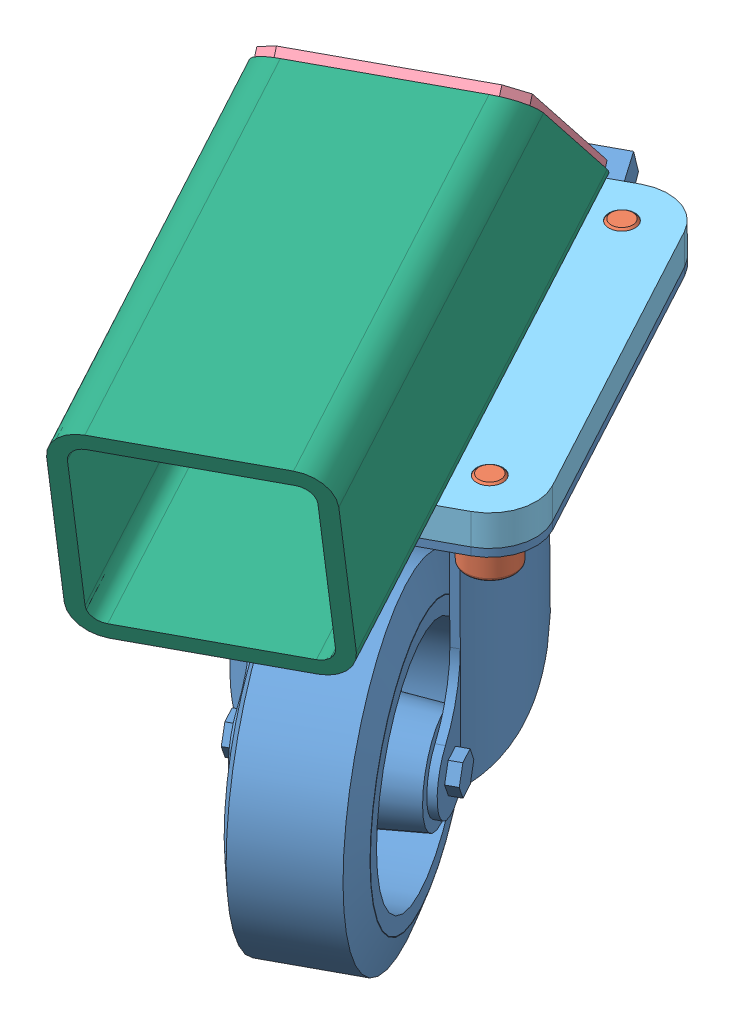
SolidWorks assembly Montage des roulettes.SLDASM, configuration Défaut (file format 5000). Lengths in mm.
Overall size (242.46 312.54 295.72).
13 component instances, 6 part files, 8 mates.
Components (placement in the parent):
- Roulette-1: Roulette.SLDPRT [Défaut] at (-390.9889 -260.5811 -478.0656) x (-0.472758 0.004166 -0.881182) z (0.881192 0.002235 -0.472753) size (199 139 110)
- Vis C HC, M 10x15-1: Vis C HC, M 10x15.sldprt [Défaut] at (-380.561 -264.7729 -543.259) x (-0.850954 -0.002483 0.525234) z (0.52524 -0.004023 0.850945) size (16 25 16)
- Rondelle M, 10-4: Rondelle M, 10.sldprt [Défaut] at (-380.561 -262.7729 -543.2496) x (0.142472 -0.004679 0.989788) z (0.989799 0.000674 -0.142471) size (22 2 22)
- Rondelle M, 10-5: Rondelle M, 10.sldprt [Défaut] at (-451.0564 -262.9517 -505.4293) x (0.142472 -0.004679 0.989788) z (0.989799 0.000674 -0.142471) size (22 2 22)
- Rondelle M, 10-6: Rondelle M, 10.sldprt [Défaut] at (-330.9214 -263.2103 -450.7254) x (0.142472 -0.004679 0.989788) z (0.989799 0.000674 -0.142471) size (22 2 22)
- Rondelle M, 10-7: Rondelle M, 10.sldprt [Défaut] at (-401.4168 -263.3891 -412.9052) x (0.142472 -0.004679 0.989788) z (0.989799 0.000674 -0.142471) size (22 2 22)
- Vis C HC, M 10x15-2: Vis C HC, M 10x15.sldprt [Défaut] at (-451.0564 -264.9517 -505.4388) x (-0.850954 -0.002483 0.525234) z (0.52524 -0.004023 0.850945) size (16 25 16)
- Vis C HC, M 10x15-3: Vis C HC, M 10x15.sldprt [Défaut] at (-330.9214 -265.2103 -450.7349) x (-0.850954 -0.002483 0.525234) z (0.52524 -0.004023 0.850945) size (16 25 16)
- Vis C HC, M 10x15-4: Vis C HC, M 10x15.sldprt [Défaut] at (-401.4168 -265.3891 -412.9147) x (-0.850954 -0.002483 0.525234) z (0.52524 -0.004023 0.850945) size (16 25 16)
- Extremité chariot-1: Extremité chariot.SLDASM [Défaut] at (-406.3544 -215.448 -506.4928) x (-0.881192 -0.002235 0.472753) z (-0.334291 0.710045 -0.619747) size (110 215.89 208.82)
  - Bouchon chariot 95 x 66 x 3-1: Bouchon chariot 95 x 66 x 3.SLDPRT [Défaut] at origin size (66 95 3)
  - Platine chariot 140 x 115 x 10-1: Platine chariot 140 x 115 x 10.SLDPRT [Défaut] at (0 -8.8363 -54.8008) x (0 0.707107 -0.707107) z (0 0.707107 0.707107) size (135 110 10)
  - Tube carré chariot 70 x 70 x 5 x 225.3-1: Tube carré chariot 70 x 70 x 5 x 225.3.SLDPRT [Défaut] at (0 134.5801 -134.5776) x (1 0 0) z (0 -0.707107 0.707107) size (70 70 225.32)
Mates (geometry in assembly coordinates):
- Coaxiale19: concentric anti-aligned: cylinder of Vis C HC, M 10x15-1 through (-380.561 -249.7731 -543.1881) axis (0 -0.999989 -0.004727) radius 5; cylinder of Rondelle M, 10-4 through (-380.561 -262.7729 -543.2496) axis (0 0.999989 0.004727) radius 5.25
- Coïncidente15: coincident anti-aligned: plane of Vis C HC, M 10x15-1 through (-380.561 -264.7729 -543.259) normal (0 0.999989 0.004727); plane of Rondelle M, 10-4 through (-378.9938 -264.8244 -532.3714) normal (0 -0.999989 -0.004727)
- Coïncidente16: coincident anti-aligned: plane of Roulette-1 through (-401.4168 -263.3891 -412.9052) normal (0 -0.999989 -0.004727); plane of Rondelle M, 10-4 through (-379.813 -262.7975 -538.0532) normal (0 0.999989 0.004727)
- Coïncidente29: coincident anti-aligned: plane of Extremité chariot-1/Platine chariot 140 x 115 x 10-1 through (-390.9889 -260.5811 -478.0656) normal (0 -0.999989 -0.004727); plane of Roulette-1 through (-401.4168 -260.8892 -412.8934) normal (0 0.999989 0.004727)
- Coaxiale25: concentric anti-aligned: cylinder of Extremité chariot-1/Platine chariot 140 x 115 x 10-1 through (-401.4168 -250.8893 -412.8461) axis (0 0.999989 0.004727) radius 4.25; cylinder of Roulette-1 through (-401.4168 -260.8892 -412.8934) axis (0 -0.999989 -0.004727) radius 5.5
- Coaxiale26: concentric anti-aligned: cylinder of Extremité chariot-1/Platine chariot 140 x 115 x 10-1 through (-401.4168 -250.8893 -412.8461) axis (0 0.999989 0.004727) radius 4.25; cylinder of Roulette-1 through (-401.4168 -260.8892 -412.8934) axis (0 -0.999989 -0.004727) radius 5.5
- Coaxiale27: concentric anti-aligned: cylinder of Extremité chariot-1/Platine chariot 140 x 115 x 10-1 through (-380.561 -250.2731 -543.1905) axis (0 0.999989 0.004727) radius 4.25; cylinder of Roulette-1 through (-380.561 -260.273 -543.2378) axis (0 -0.999989 -0.004727) radius 5.5
- Coaxiale28: concentric anti-aligned: cylinder of Extremité chariot-1/Platine chariot 140 x 115 x 10-1 through (-380.561 -250.2731 -543.1905) axis (0 0.999989 0.004727) radius 4.25; cylinder of Vis C HC, M 10x15-1 through (-380.561 -249.7731 -543.1881) axis (0 -0.999989 -0.004727) radius 5
